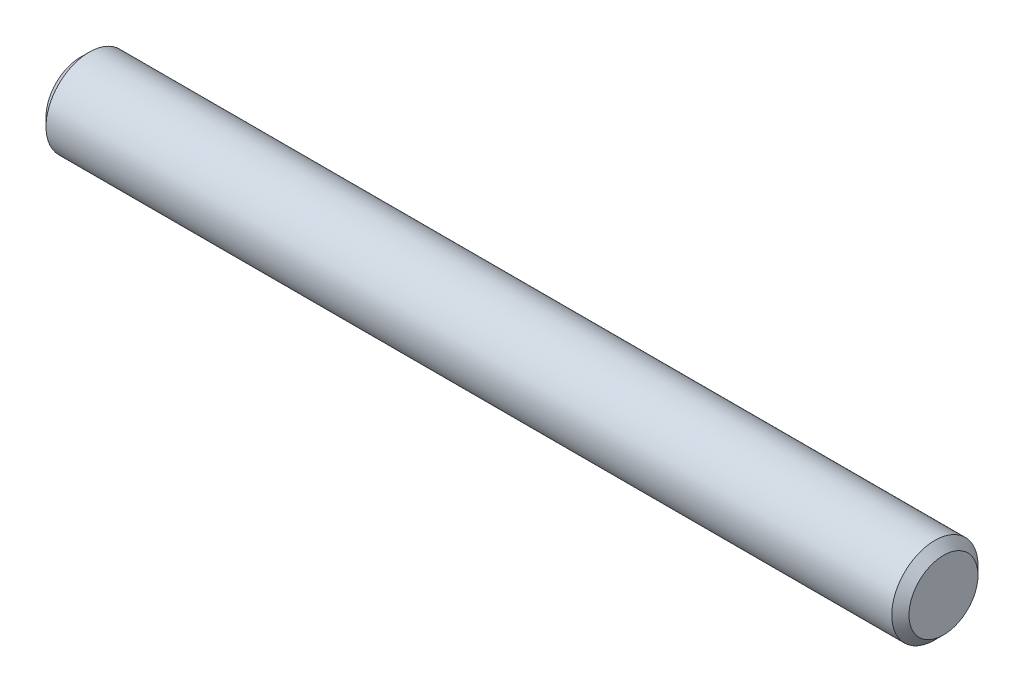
from build123d import *

# Parameters (mm, degrees)
EXTRUDE1_DEPTH      = 15.875
EXTRUDE1_DEPTH_BACK = 15.875
SKETCH2_R           = 1.5875
CHAMFER1_SIZE       = 0.3175


with BuildPart() as part:
    # Sketch2 → Extrude1 (new, two sides: drawn at the far end of the back side and taken through both)
    with BuildSketch(Plane(origin=(0, 0, 0), x_dir=(0, 0, -1), z_dir=(1, 0, 0)).offset(-EXTRUDE1_DEPTH_BACK)):
        Circle(SKETCH2_R)
    extrude(amount=EXTRUDE1_DEPTH + EXTRUDE1_DEPTH_BACK)

    # Chamfer1
    chamfer1_edges = [part.edges().sort_by_distance(p)[0] for p in [
        (-15.875, 0, 1.5875),
        (15.875, 0, 1.5875),
    ]]
    chamfer(chamfer1_edges, length=CHAMFER1_SIZE)


solid = part.part
